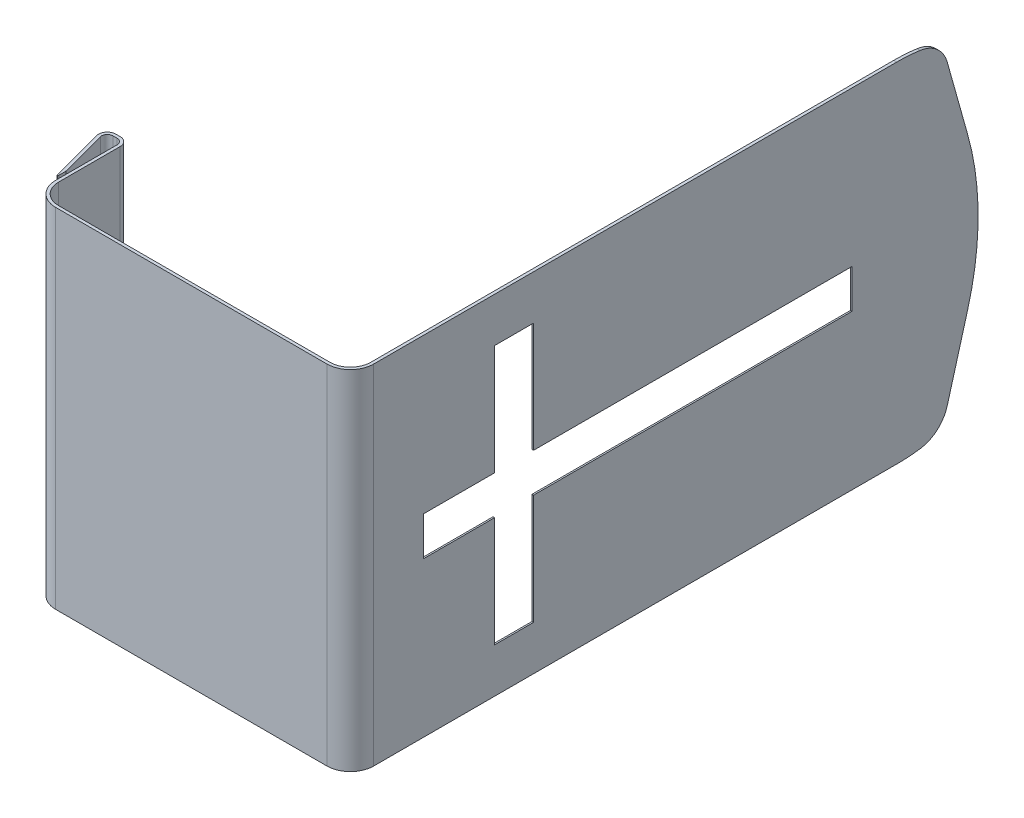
from build123d import *

# Parameters (mm, degrees)
SKETCH1_W           = 372.126511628
SKETCH1_H           = 554
BOSS_EXTRUDE1_DEPTH = 3.175
CUT_EXTRUDE1_DEPTH  = 3.175
CHAMFER1_SIZE       = 1.524
BOSS_EXTRUDE2_DEPTH = 186.063255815
BOSS_EXTRUDE3_DEPTH = 3.175


with BuildPart() as part:
    # Sketch1 → Boss-Extrude1 (new body)
    with BuildSketch(Plane.YZ):
        Rectangle(SKETCH1_W, SKETCH1_H)
    extrude(amount=BOSS_EXTRUDE1_DEPTH)

    # sk cross 2 → Cut-Extrude1 (cut)
    with BuildSketch(Plane.YZ):
        Polygon((-20.75, 229), (20.75, 229), (20.75, 152.75), (138.525, 152.75), (138.525, 111.25), (20.75, 111.25), (20.75, -229), (-20.75, -229), (-20.75, 111.25), (-138.475, 111.25), (-138.475, 152.75), (-20.75, 152.75), align=None)
    extrude(amount=CUT_EXTRUDE1_DEPTH, mode=Mode.SUBTRACT)

    # Chamfer1
    chamfer1_edges = [part.edges().sort_by_distance(p)[0] for p in [
        (0, -20.75, 190.875),
        (0, -79.6125, 152.75),
        (0, -138.475, 132),
        (0, -79.6125, 111.25),
        (0, -20.75, -58.875),
        (0, 0, -229),
        (0, 20.75, -58.875),
        (0, 79.6375, 111.25),
        (0, 138.525, 132),
        (0, 79.6375, 152.75),
        (0, 20.75, 190.875),
        (0, 0, 229),
    ]]
    chamfer(chamfer1_edges, length=CHAMFER1_SIZE)

    # Sketch2 → Boss-Extrude2 (add, symmetric)
    with BuildSketch(Plane(origin=(0, 0, 0), x_dir=(-1, 0, 0), z_dir=(0, 1, 0))):
        with BuildLine():
            Line((0, 277), (0, 282))
            ThreePointArc((0, 282), (6.392394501, 297.432605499), (21.825, 303.825))
            Line((21.825, 303.825), (311.825, 303.825))
            ThreePointArc((311.825, 303.825), (327.257605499, 297.432605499), (333.65, 282))
            Line((333.65, 282), (333.65, 216.175))
            ThreePointArc((333.65, 216.175), (336.337295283, 209.687295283), (342.825, 207))
            Line((342.825, 207), (347.457699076, 207))
            ThreePointArc((347.457699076, 207), (354.736715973, 210.589613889), (356.320068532, 218.549664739))
            Line((356.320068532, 218.549664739), (340.790925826, 276.505214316))
            Line((340.790925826, 276.505214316), (340.566180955, 276.444994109))
            ThreePointArc((340.566180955, 276.444994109), (340.03164666, 276.087829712), (339.825, 275.479068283))
            Line((339.825, 275.479068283), (339.825, 267.97449308))
            ThreePointArc((339.825, 267.97449308), (339.833555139, 267.843966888), (339.859074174, 267.715674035))
            Line((339.859074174, 267.715674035), (353.253254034, 217.727914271))
            ThreePointArc((353.253254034, 217.727914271), (352.217819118, 212.522431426), (347.457699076, 210.175))
            Line((347.457699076, 210.175), (342.825, 210.175))
            ThreePointArc((342.825, 210.175), (338.582359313, 211.932359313), (336.825, 216.175))
            Line((336.825, 216.175), (336.825, 282))
            ThreePointArc((336.825, 282), (329.50266953, 299.67766953), (311.825, 307))
            Line((311.825, 307), (21.825, 307))
            ThreePointArc((21.825, 307), (4.14733047, 299.67766953), (-3.175, 282))
            Line((-3.175, 282), (-3.175, 277))
            Line((-3.175, 277), (0, 277))
        make_face()
    extrude(amount=BOSS_EXTRUDE2_DEPTH, both=True)

    # Sketch3 → Boss-Extrude3 (add)
    with BuildSketch(Plane.YZ):
        with BuildLine():
            Line((-159.149882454, -330.923346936), (-80.968066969, -352.837339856))
            ThreePointArc((-80.968066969, -352.837339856), (0, -363.970290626), (80.968066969, -352.837339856))
            Line((80.968066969, -352.837339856), (159.149882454, -330.923346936))
            ThreePointArc((159.149882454, -330.923346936), (176.111408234, -320.1923476), (184.388589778, -301.907491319))
            ThreePointArc((184.388589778, -301.907491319), (185.644117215, -289.481863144), (186.063255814, -277))
            Line((186.063255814, -277), (-186.063255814, -277))
            ThreePointArc((-186.063255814, -277), (-185.644117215, -289.481863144), (-184.388589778, -301.907491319))
            ThreePointArc((-184.388589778, -301.907491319), (-176.111408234, -320.1923476), (-159.149882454, -330.923346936))
        make_face()
    extrude(amount=BOSS_EXTRUDE3_DEPTH)


solid = part.part
